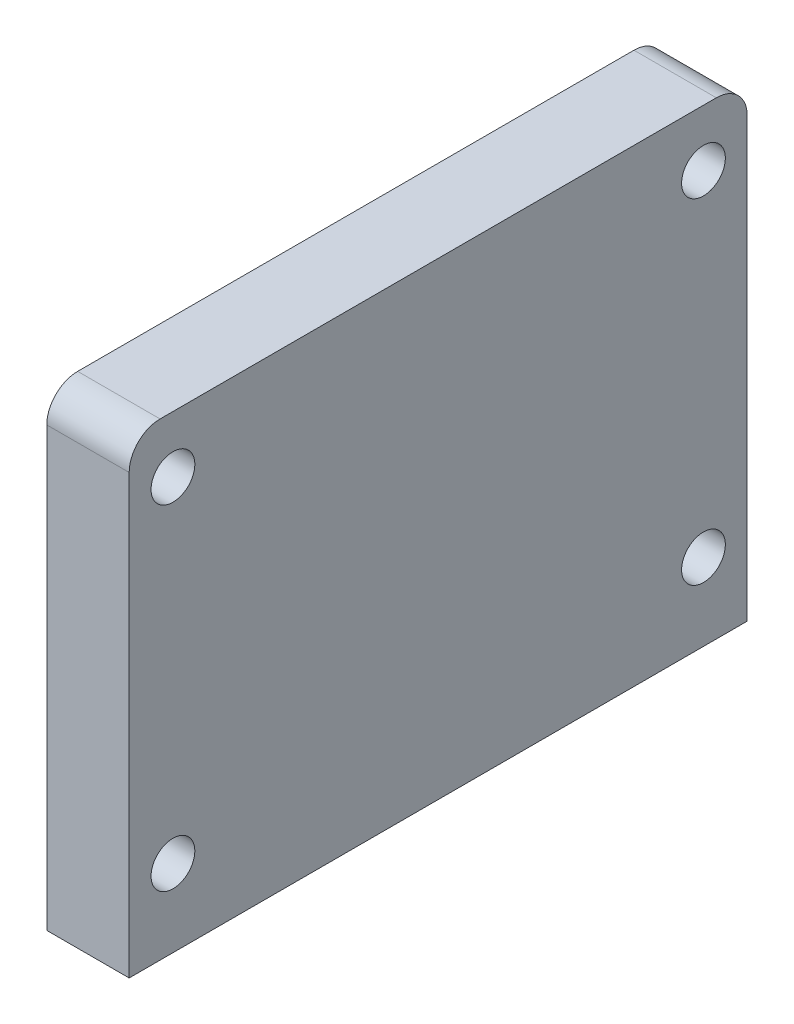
from build123d import *

# Parameters (mm, degrees)
LINEAR_AUSTRAGEN1_DEPTH   = 16
M10_GEWINDEBOHRUNG1_D     = 8.5
M10_GEWINDEBOHRUNG1_DEPTH = 27.5
M10_GEWINDEBOHRUNG1_TIP   = 2.553657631


with BuildPart() as part:
    # Skizze9 → Linear austragen1 (new body)
    with BuildSketch(Plane.ZY):
        with BuildLine():
            Line((60, -48), (-60, -48))
            Line((-60, -48), (-60, 37))
            ThreePointArc((-60, 37), (-58.242640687, 41.242640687), (-54, 43))
            Line((-54, 43), (54, 43))
            ThreePointArc((54, 43), (58.242640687, 41.242640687), (60, 37))
            Line((60, 37), (60, -48))
        make_face()
    extrude(amount=LINEAR_AUSTRAGEN1_DEPTH)

    # M10 Gewindebohrung1
    with Locations(Plane(origin=(0, 0, 0), x_dir=(0, 0, -1), z_dir=(1, 0, 0))):
        with Locations((-51.5, 32), (-51.5, -33), (51.5, 32), (51.5, -33)):
            Hole(M10_GEWINDEBOHRUNG1_D / 2, depth=M10_GEWINDEBOHRUNG1_DEPTH)
            with Locations((0, 0, -(M10_GEWINDEBOHRUNG1_DEPTH + M10_GEWINDEBOHRUNG1_TIP / 2))):  # 118° drill point
                Cone(0, M10_GEWINDEBOHRUNG1_D / 2, M10_GEWINDEBOHRUNG1_TIP, mode=Mode.SUBTRACT)


solid = part.part
